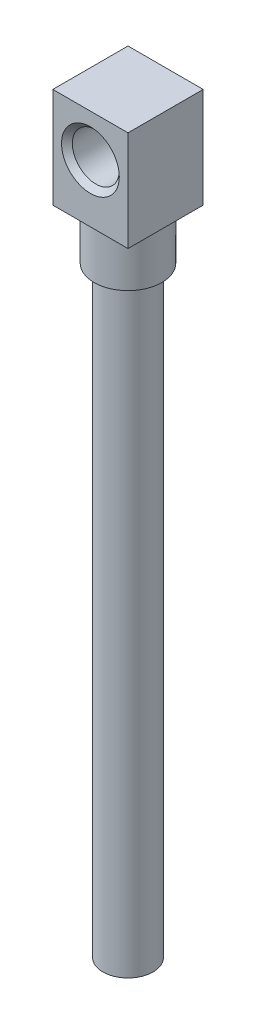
from build123d import *

# Parameters (mm, degrees)
SKETCH1_W                              = 19.05
SKETCH1_H                              = 19.05
BOSS_EXTRUDE1_DEPTH                    = 25.4
SKETCH2_R                              = 8.5725
BOSS_EXTRUDE2_DEPTH                    = 12.7
SKETCH3_R                              = 6.35
BOSS_EXTRUDE3_DEPTH                    = 152.4
F_1_4_18_NPSM_TAPPED_HOLE1_D           = 11.8872
F_1_4_18_NPSM_TAPPED_HOLE1_CSINK_D     = 14.6304
F_1_4_18_NPSM_TAPPED_HOLE1_CSINK_ANGLE = 90


with BuildPart() as part:
    # Sketch1 → Boss-Extrude1 (new body)
    with BuildSketch(Plane(origin=(0, 0, 0), x_dir=(1, 0, 0), z_dir=(0, 1, 0))):
        Rectangle(SKETCH1_W, SKETCH1_H)
    extrude(amount=BOSS_EXTRUDE1_DEPTH)

    # Sketch2 → Boss-Extrude2 (add)
    with BuildSketch(Plane.XZ):
        with Locations(Location((0, 0, 0), (0, 0, 270))):
            Circle(SKETCH2_R)
    extrude(amount=BOSS_EXTRUDE2_DEPTH)

    # Sketch3 → Boss-Extrude3 (add)
    with BuildSketch(Plane.XZ.offset(12.7)):
        with Locations(Location((0, 0, 0), (0, 0, 90))):
            Circle(SKETCH3_R)
    extrude(amount=BOSS_EXTRUDE3_DEPTH)

    # 1_4-18 NPSM Tapped Hole1 (through all)
    with Locations(Plane.XY.offset(9.525)):
        with Locations((0, 14.654022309)):
            CounterSinkHole(F_1_4_18_NPSM_TAPPED_HOLE1_D / 2, F_1_4_18_NPSM_TAPPED_HOLE1_CSINK_D / 2, counter_sink_angle=F_1_4_18_NPSM_TAPPED_HOLE1_CSINK_ANGLE)


solid = part.part
